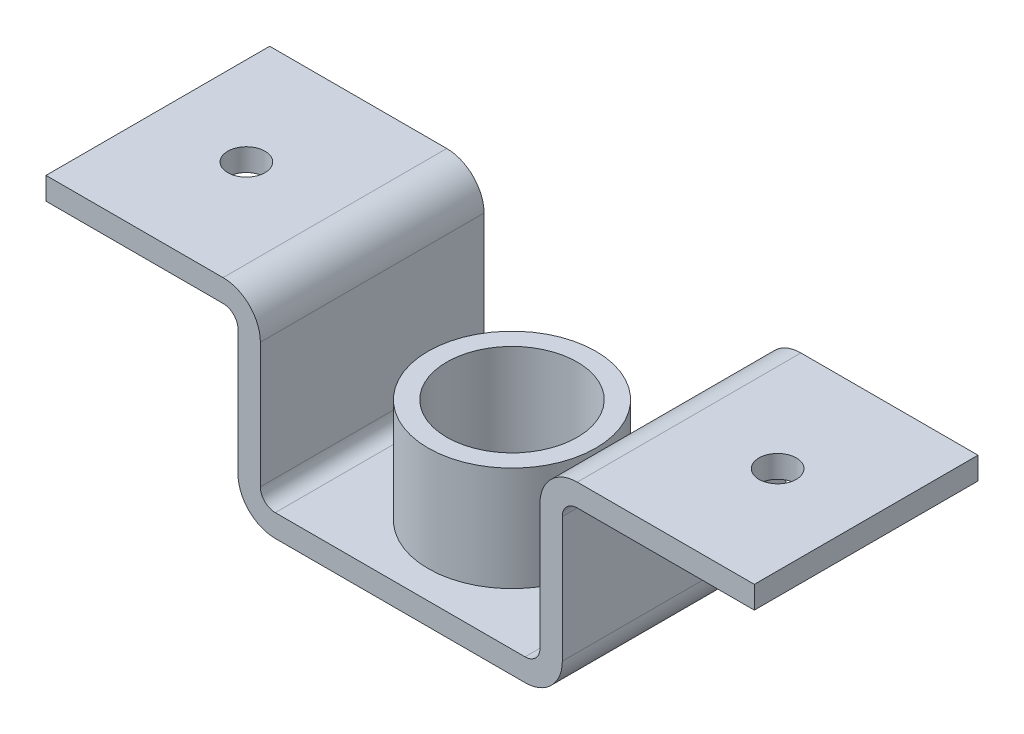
ISO-10303-21;
HEADER;
FILE_DESCRIPTION(('STEP AP214'),'2;1');
FILE_NAME('part.step','',(''),(''),'','','');
FILE_SCHEMA(('AUTOMOTIVE_DESIGN { 1 0 10303 214 1 1 1 1 }'));
ENDSEC;
DATA;
#1=APPLICATION_CONTEXT('core data for automotive mechanical design processes');
#2=APPLICATION_PROTOCOL_DEFINITION('international standard','automotive_design',2000,#1);
#3=PRODUCT_CONTEXT('',#1,'mechanical');
#4=PRODUCT('Part','Part','',(#3));
#5=PRODUCT_RELATED_PRODUCT_CATEGORY('part','',(#4));
#6=PRODUCT_DEFINITION_FORMATION('','',#4);
#7=PRODUCT_DEFINITION_CONTEXT('part definition',#1,'design');
#8=PRODUCT_DEFINITION('design','',#6,#7);
#9=PRODUCT_DEFINITION_SHAPE('','',#8);
#10=(LENGTH_UNIT() NAMED_UNIT(*) SI_UNIT(.MILLI.,.METRE.));
#11=(NAMED_UNIT(*) PLANE_ANGLE_UNIT() SI_UNIT($,.RADIAN.));
#12=(NAMED_UNIT(*) SI_UNIT($,.STERADIAN.) SOLID_ANGLE_UNIT());
#13=UNCERTAINTY_MEASURE_WITH_UNIT(LENGTH_MEASURE(1.E-05),#10,'distance_accuracy_value','');
#14=(GEOMETRIC_REPRESENTATION_CONTEXT(3) GLOBAL_UNCERTAINTY_ASSIGNED_CONTEXT((#13)) GLOBAL_UNIT_ASSIGNED_CONTEXT((#10,
#11,#12)) REPRESENTATION_CONTEXT('',''));
#15=CARTESIAN_POINT('',(0.,0.,0.));
#16=DIRECTION('',(0.,0.,1.));
#17=DIRECTION('',(1.,0.,0.));
#18=AXIS2_PLACEMENT_3D('',#15,#16,#17);
#19=CARTESIAN_POINT('',(-187.5,30.,150.));
#20=DIRECTION('',(0.,-1.,0.));
#21=DIRECTION('',(0.,0.,-1.));
#22=AXIS2_PLACEMENT_3D('',#19,#20,#21);
#23=PLANE('',#22);
#24=CARTESIAN_POINT('',(0.,30.,0.));
#25=DIRECTION('',(0.,1.,0.));
#26=DIRECTION('',(0.,0.,1.));
#27=AXIS2_PLACEMENT_3D('',#24,#25,#26);
#28=CIRCLE('',#27,37.5);
#29=CARTESIAN_POINT('',(0.,30.,37.5));
#30=VERTEX_POINT('',#29);
#31=EDGE_CURVE('E407',#30,#30,#28,.T.);
#32=ORIENTED_EDGE('',*,*,#31,.F.);
#33=EDGE_LOOP('',(#32));
#34=FACE_BOUND('',#33,.T.);
#35=CARTESIAN_POINT('',(0.,30.,0.));
#36=DIRECTION('',(0.,1.,0.));
#37=DIRECTION('',(0.,0.,1.));
#38=AXIS2_PLACEMENT_3D('',#35,#36,#37);
#39=CIRCLE('',#38,87.5);
#40=CARTESIAN_POINT('',(0.,30.,87.5));
#41=VERTEX_POINT('',#40);
#42=EDGE_CURVE('E414',#41,#41,#39,.T.);
#43=ORIENTED_EDGE('',*,*,#42,.T.);
#44=EDGE_LOOP('',(#43));
#45=FACE_BOUND('',#44,.T.);
#46=ADVANCED_FACE('F39',(#34,#45),#23,.F.);
#47=CARTESIAN_POINT('',(187.5,30.,150.));
#48=DIRECTION('',(1.,0.,0.));
#49=DIRECTION('',(0.,1.,0.));
#50=AXIS2_PLACEMENT_3D('',#47,#48,#49);
#51=PLANE('',#50);
#52=DIRECTION('',(0.,-1.,0.));
#53=VECTOR('',#52,1.);
#54=CARTESIAN_POINT('',(187.5,30.,150.));
#55=LINE('',#54,#53);
#56=CARTESIAN_POINT('',(187.5,218.,150.));
#57=VERTEX_POINT('',#56);
#58=CARTESIAN_POINT('',(187.5,50.,150.));
#59=VERTEX_POINT('',#58);
#60=EDGE_CURVE('E253',#57,#59,#55,.T.);
#61=ORIENTED_EDGE('',*,*,#60,.F.);
#62=DIRECTION('',(0.,0.,-1.));
#63=VECTOR('',#62,1.);
#64=CARTESIAN_POINT('',(187.5,218.,150.));
#65=LINE('',#64,#63);
#66=CARTESIAN_POINT('',(187.5,218.,-150.));
#67=VERTEX_POINT('',#66);
#68=EDGE_CURVE('E323',#57,#67,#65,.T.);
#69=ORIENTED_EDGE('',*,*,#68,.T.);
#70=DIRECTION('',(0.,-1.,0.));
#71=VECTOR('',#70,1.);
#72=CARTESIAN_POINT('',(187.5,30.,-150.));
#73=LINE('',#72,#71);
#74=CARTESIAN_POINT('',(187.5,50.,-150.));
#75=VERTEX_POINT('',#74);
#76=EDGE_CURVE('E224',#67,#75,#73,.T.);
#77=ORIENTED_EDGE('',*,*,#76,.T.);
#78=DIRECTION('',(0.,0.,-1.));
#79=VECTOR('',#78,1.);
#80=CARTESIAN_POINT('',(187.5,50.,150.));
#81=LINE('',#80,#79);
#82=EDGE_CURVE('E275',#75,#59,#81,.F.);
#83=ORIENTED_EDGE('',*,*,#82,.T.);
#84=EDGE_LOOP('',(#61,#69,#77,#83));
#85=FACE_BOUND('',#84,.T.);
#86=ADVANCED_FACE('F390',(#85),#51,.F.);
#87=CARTESIAN_POINT('',(0.,30.,0.));
#88=DIRECTION('',(0.,-1.,0.));
#89=DIRECTION('',(0.,0.,-1.));
#90=AXIS2_PLACEMENT_3D('',#87,#88,#89);
#91=CIRCLE('',#90,112.5);
#92=CARTESIAN_POINT('',(0.,30.,-112.5));
#93=VERTEX_POINT('',#92);
#94=EDGE_CURVE('E11',#93,#93,#91,.F.);
#95=ORIENTED_EDGE('',*,*,#94,.F.);
#96=EDGE_LOOP('',(#95));
#97=FACE_BOUND('',#96,.T.);
#98=DIRECTION('',(-1.,0.,0.));
#99=VECTOR('',#98,1.);
#100=CARTESIAN_POINT('',(-187.5,30.,150.));
#101=LINE('',#100,#99);
#102=CARTESIAN_POINT('',(167.5,30.,150.));
#103=VERTEX_POINT('',#102);
#104=CARTESIAN_POINT('',(-167.5,30.,150.));
#105=VERTEX_POINT('',#104);
#106=EDGE_CURVE('E337',#103,#105,#101,.T.);
#107=ORIENTED_EDGE('',*,*,#106,.F.);
#108=DIRECTION('',(0.,0.,-1.));
#109=VECTOR('',#108,1.);
#110=CARTESIAN_POINT('',(167.5,30.,-150.));
#111=LINE('',#110,#109);
#112=CARTESIAN_POINT('',(167.5,30.,-150.));
#113=VERTEX_POINT('',#112);
#114=EDGE_CURVE('E272',#103,#113,#111,.T.);
#115=ORIENTED_EDGE('',*,*,#114,.T.);
#116=DIRECTION('',(-1.,0.,0.));
#117=VECTOR('',#116,1.);
#118=CARTESIAN_POINT('',(-187.5,30.,-150.));
#119=LINE('',#118,#117);
#120=CARTESIAN_POINT('',(-167.5,30.,-150.));
#121=VERTEX_POINT('',#120);
#122=EDGE_CURVE('E226',#113,#121,#119,.T.);
#123=ORIENTED_EDGE('',*,*,#122,.T.);
#124=DIRECTION('',(0.,0.,-1.));
#125=VECTOR('',#124,1.);
#126=CARTESIAN_POINT('',(-167.5,30.,150.));
#127=LINE('',#126,#125);
#128=EDGE_CURVE('E270',#121,#105,#127,.F.);
#129=ORIENTED_EDGE('',*,*,#128,.T.);
#130=EDGE_LOOP('',(#107,#115,#123,#129));
#131=FACE_BOUND('',#130,.T.);
#132=ADVANCED_FACE('F400',(#97,#131),#23,.F.);
#133=CARTESIAN_POINT('',(-187.5,30.,150.));
#134=DIRECTION('',(-1.,0.,0.));
#135=DIRECTION('',(0.,0.,1.));
#136=AXIS2_PLACEMENT_3D('',#133,#134,#135);
#137=PLANE('',#136);
#138=DIRECTION('',(0.,1.,0.));
#139=VECTOR('',#138,1.);
#140=CARTESIAN_POINT('',(-187.5,30.,-150.));
#141=LINE('',#140,#139);
#142=CARTESIAN_POINT('',(-187.5,50.,-150.));
#143=VERTEX_POINT('',#142);
#144=CARTESIAN_POINT('',(-187.5,218.,-150.));
#145=VERTEX_POINT('',#144);
#146=EDGE_CURVE('E230',#143,#145,#141,.T.);
#147=ORIENTED_EDGE('',*,*,#146,.T.);
#148=DIRECTION('',(0.,0.,-1.));
#149=VECTOR('',#148,1.);
#150=CARTESIAN_POINT('',(-187.5,218.,150.));
#151=LINE('',#150,#149);
#152=CARTESIAN_POINT('',(-187.5,218.,150.));
#153=VERTEX_POINT('',#152);
#154=EDGE_CURVE('E47',#145,#153,#151,.F.);
#155=ORIENTED_EDGE('',*,*,#154,.T.);
#156=DIRECTION('',(0.,1.,0.));
#157=VECTOR('',#156,1.);
#158=CARTESIAN_POINT('',(-187.5,30.,150.));
#159=LINE('',#158,#157);
#160=CARTESIAN_POINT('',(-187.5,50.,150.));
#161=VERTEX_POINT('',#160);
#162=EDGE_CURVE('E191',#161,#153,#159,.T.);
#163=ORIENTED_EDGE('',*,*,#162,.F.);
#164=DIRECTION('',(0.,0.,-1.));
#165=VECTOR('',#164,1.);
#166=CARTESIAN_POINT('',(-187.5,50.,-150.));
#167=LINE('',#166,#165);
#168=EDGE_CURVE('E278',#161,#143,#167,.T.);
#169=ORIENTED_EDGE('',*,*,#168,.T.);
#170=EDGE_LOOP('',(#147,#155,#163,#169));
#171=FACE_BOUND('',#170,.T.);
#172=ADVANCED_FACE('F331',(#171),#137,.F.);
#173=CARTESIAN_POINT('',(-187.5,268.,150.));
#174=DIRECTION('',(0.,-1.,0.));
#175=DIRECTION('',(1.,0.,0.));
#176=AXIS2_PLACEMENT_3D('',#173,#174,#175);
#177=PLANE('',#176);
#178=CARTESIAN_POINT('',(-356.25,268.,0.));
#179=DIRECTION('',(0.,1.,0.));
#180=DIRECTION('',(0.,0.,1.));
#181=AXIS2_PLACEMENT_3D('',#178,#179,#180);
#182=CIRCLE('',#181,25.);
#183=CARTESIAN_POINT('',(-356.25,268.,25.));
#184=VERTEX_POINT('',#183);
#185=EDGE_CURVE('E422',#184,#184,#182,.T.);
#186=ORIENTED_EDGE('',*,*,#185,.F.);
#187=EDGE_LOOP('',(#186));
#188=FACE_BOUND('',#187,.T.);
#189=DIRECTION('',(-1.,0.,0.));
#190=VECTOR('',#189,1.);
#191=CARTESIAN_POINT('',(-187.5,268.,150.));
#192=LINE('',#191,#190);
#193=CARTESIAN_POINT('',(-237.5,268.,150.));
#194=VERTEX_POINT('',#193);
#195=CARTESIAN_POINT('',(-475.,268.,150.));
#196=VERTEX_POINT('',#195);
#197=EDGE_CURVE('E177',#194,#196,#192,.T.);
#198=ORIENTED_EDGE('',*,*,#197,.F.);
#199=DIRECTION('',(0.,0.,-1.));
#200=VECTOR('',#199,1.);
#201=CARTESIAN_POINT('',(-237.5,268.,150.));
#202=LINE('',#201,#200);
#203=CARTESIAN_POINT('',(-237.5,268.,-150.));
#204=VERTEX_POINT('',#203);
#205=EDGE_CURVE('E327',#194,#204,#202,.T.);
#206=ORIENTED_EDGE('',*,*,#205,.T.);
#207=DIRECTION('',(-1.,0.,0.));
#208=VECTOR('',#207,1.);
#209=CARTESIAN_POINT('',(-187.5,268.,-150.));
#210=LINE('',#209,#208);
#211=CARTESIAN_POINT('',(-475.,268.,-150.));
#212=VERTEX_POINT('',#211);
#213=EDGE_CURVE('E197',#204,#212,#210,.T.);
#214=ORIENTED_EDGE('',*,*,#213,.T.);
#215=DIRECTION('',(0.,0.,-1.));
#216=VECTOR('',#215,1.);
#217=CARTESIAN_POINT('',(-475.,268.,150.));
#218=LINE('',#217,#216);
#219=EDGE_CURVE('E194',#196,#212,#218,.T.);
#220=ORIENTED_EDGE('',*,*,#219,.F.);
#221=EDGE_LOOP('',(#198,#206,#214,#220));
#222=FACE_BOUND('',#221,.T.);
#223=ADVANCED_FACE('F195',(#188,#222),#177,.F.);
#224=CARTESIAN_POINT('',(-475.,238.,150.));
#225=DIRECTION('',(1.,0.,0.));
#226=DIRECTION('',(0.,0.,-1.));
#227=AXIS2_PLACEMENT_3D('',#224,#225,#226);
#228=PLANE('',#227);
#229=DIRECTION('',(0.,-1.,0.));
#230=VECTOR('',#229,1.);
#231=CARTESIAN_POINT('',(-475.,238.,-150.));
#232=LINE('',#231,#230);
#233=CARTESIAN_POINT('',(-475.,238.,-150.));
#234=VERTEX_POINT('',#233);
#235=EDGE_CURVE('E234',#212,#234,#232,.T.);
#236=ORIENTED_EDGE('',*,*,#235,.T.);
#237=DIRECTION('',(0.,0.,-1.));
#238=VECTOR('',#237,1.);
#239=CARTESIAN_POINT('',(-475.,238.,150.));
#240=LINE('',#239,#238);
#241=CARTESIAN_POINT('',(-475.,238.,150.));
#242=VERTEX_POINT('',#241);
#243=EDGE_CURVE('E201',#242,#234,#240,.T.);
#244=ORIENTED_EDGE('',*,*,#243,.F.);
#245=DIRECTION('',(0.,-1.,0.));
#246=VECTOR('',#245,1.);
#247=CARTESIAN_POINT('',(-475.,238.,150.));
#248=LINE('',#247,#246);
#249=EDGE_CURVE('E183',#196,#242,#248,.T.);
#250=ORIENTED_EDGE('',*,*,#249,.F.);
#251=ORIENTED_EDGE('',*,*,#219,.T.);
#252=EDGE_LOOP('',(#236,#244,#250,#251));
#253=FACE_BOUND('',#252,.T.);
#254=ADVANCED_FACE('F203',(#253),#228,.F.);
#255=CARTESIAN_POINT('',(-217.5,238.,150.));
#256=DIRECTION('',(0.,1.,0.));
#257=DIRECTION('',(-1.,0.,0.));
#258=AXIS2_PLACEMENT_3D('',#255,#256,#257);
#259=PLANE('',#258);
#260=CARTESIAN_POINT('',(-356.25,238.,0.));
#261=DIRECTION('',(0.,1.,0.));
#262=DIRECTION('',(-1.,0.,0.));
#263=AXIS2_PLACEMENT_3D('',#260,#261,#262);
#264=CIRCLE('',#263,25.);
#265=CARTESIAN_POINT('',(-381.25,238.,0.));
#266=VERTEX_POINT('',#265);
#267=EDGE_CURVE('E417',#266,#266,#264,.F.);
#268=ORIENTED_EDGE('',*,*,#267,.F.);
#269=EDGE_LOOP('',(#268));
#270=FACE_BOUND('',#269,.T.);
#271=DIRECTION('',(1.,0.,0.));
#272=VECTOR('',#271,1.);
#273=CARTESIAN_POINT('',(-217.5,238.,-150.));
#274=LINE('',#273,#272);
#275=CARTESIAN_POINT('',(-237.5,238.,-150.));
#276=VERTEX_POINT('',#275);
#277=EDGE_CURVE('E236',#234,#276,#274,.T.);
#278=ORIENTED_EDGE('',*,*,#277,.T.);
#279=DIRECTION('',(0.,0.,-1.));
#280=VECTOR('',#279,1.);
#281=CARTESIAN_POINT('',(-237.5,238.,150.));
#282=LINE('',#281,#280);
#283=CARTESIAN_POINT('',(-237.5,238.,150.));
#284=VERTEX_POINT('',#283);
#285=EDGE_CURVE('E262',#276,#284,#282,.F.);
#286=ORIENTED_EDGE('',*,*,#285,.T.);
#287=DIRECTION('',(1.,0.,0.));
#288=VECTOR('',#287,1.);
#289=CARTESIAN_POINT('',(-217.5,238.,150.));
#290=LINE('',#289,#288);
#291=EDGE_CURVE('E206',#242,#284,#290,.T.);
#292=ORIENTED_EDGE('',*,*,#291,.F.);
#293=ORIENTED_EDGE('',*,*,#243,.T.);
#294=EDGE_LOOP('',(#278,#286,#292,#293));
#295=FACE_BOUND('',#294,.T.);
#296=ADVANCED_FACE('F343',(#270,#295),#259,.F.);
#297=CARTESIAN_POINT('',(-217.5,0.,150.));
#298=DIRECTION('',(1.,0.,0.));
#299=DIRECTION('',(0.,1.,0.));
#300=AXIS2_PLACEMENT_3D('',#297,#298,#299);
#301=PLANE('',#300);
#302=DIRECTION('',(0.,-1.,0.));
#303=VECTOR('',#302,1.);
#304=CARTESIAN_POINT('',(-217.5,0.,-150.));
#305=LINE('',#304,#303);
#306=CARTESIAN_POINT('',(-217.5,218.,-150.));
#307=VERTEX_POINT('',#306);
#308=CARTESIAN_POINT('',(-217.5,50.,-150.));
#309=VERTEX_POINT('',#308);
#310=EDGE_CURVE('E239',#307,#309,#305,.T.);
#311=ORIENTED_EDGE('',*,*,#310,.T.);
#312=DIRECTION('',(0.,0.,-1.));
#313=VECTOR('',#312,1.);
#314=CARTESIAN_POINT('',(-217.5,50.,150.));
#315=LINE('',#314,#313);
#316=CARTESIAN_POINT('',(-217.5,50.,150.));
#317=VERTEX_POINT('',#316);
#318=EDGE_CURVE('E312',#309,#317,#315,.F.);
#319=ORIENTED_EDGE('',*,*,#318,.T.);
#320=DIRECTION('',(0.,-1.,0.));
#321=VECTOR('',#320,1.);
#322=CARTESIAN_POINT('',(-217.5,0.,150.));
#323=LINE('',#322,#321);
#324=CARTESIAN_POINT('',(-217.5,218.,150.));
#325=VERTEX_POINT('',#324);
#326=EDGE_CURVE('E208',#325,#317,#323,.T.);
#327=ORIENTED_EDGE('',*,*,#326,.F.);
#328=DIRECTION('',(0.,0.,-1.));
#329=VECTOR('',#328,1.);
#330=CARTESIAN_POINT('',(-217.5,218.,-150.));
#331=LINE('',#330,#329);
#332=EDGE_CURVE('E200',#325,#307,#331,.T.);
#333=ORIENTED_EDGE('',*,*,#332,.T.);
#334=EDGE_LOOP('',(#311,#319,#327,#333));
#335=FACE_BOUND('',#334,.T.);
#336=ADVANCED_FACE('F352',(#335),#301,.F.);
#337=CARTESIAN_POINT('',(-217.5,0.,150.));
#338=DIRECTION('',(0.,1.,0.));
#339=DIRECTION('',(0.,0.,1.));
#340=AXIS2_PLACEMENT_3D('',#337,#338,#339);
#341=PLANE('',#340);
#342=CARTESIAN_POINT('',(0.,0.,0.));
#343=DIRECTION('',(0.,1.,0.));
#344=DIRECTION('',(0.,0.,1.));
#345=AXIS2_PLACEMENT_3D('',#342,#343,#344);
#346=CIRCLE('',#345,37.5);
#347=CARTESIAN_POINT('',(0.,0.,37.5));
#348=VERTEX_POINT('',#347);
#349=EDGE_CURVE('E227',#348,#348,#346,.F.);
#350=ORIENTED_EDGE('',*,*,#349,.F.);
#351=EDGE_LOOP('',(#350));
#352=FACE_BOUND('',#351,.T.);
#353=DIRECTION('',(1.,0.,0.));
#354=VECTOR('',#353,1.);
#355=CARTESIAN_POINT('',(-217.5,0.,150.));
#356=LINE('',#355,#354);
#357=CARTESIAN_POINT('',(-167.5,0.,150.));
#358=VERTEX_POINT('',#357);
#359=CARTESIAN_POINT('',(167.5,0.,150.));
#360=VERTEX_POINT('',#359);
#361=EDGE_CURVE('E213',#358,#360,#356,.T.);
#362=ORIENTED_EDGE('',*,*,#361,.F.);
#363=DIRECTION('',(0.,0.,-1.));
#364=VECTOR('',#363,1.);
#365=CARTESIAN_POINT('',(-167.5,0.,150.));
#366=LINE('',#365,#364);
#367=CARTESIAN_POINT('',(-167.5,0.,-150.));
#368=VERTEX_POINT('',#367);
#369=EDGE_CURVE('E301',#358,#368,#366,.T.);
#370=ORIENTED_EDGE('',*,*,#369,.T.);
#371=DIRECTION('',(1.,0.,0.));
#372=VECTOR('',#371,1.);
#373=CARTESIAN_POINT('',(-217.5,0.,-150.));
#374=LINE('',#373,#372);
#375=CARTESIAN_POINT('',(167.5,0.,-150.));
#376=VERTEX_POINT('',#375);
#377=EDGE_CURVE('E242',#368,#376,#374,.T.);
#378=ORIENTED_EDGE('',*,*,#377,.T.);
#379=DIRECTION('',(0.,0.,-1.));
#380=VECTOR('',#379,1.);
#381=CARTESIAN_POINT('',(167.5,0.,150.));
#382=LINE('',#381,#380);
#383=EDGE_CURVE('E299',#376,#360,#382,.F.);
#384=ORIENTED_EDGE('',*,*,#383,.T.);
#385=EDGE_LOOP('',(#362,#370,#378,#384));
#386=FACE_BOUND('',#385,.T.);
#387=ADVANCED_FACE('F360',(#352,#386),#341,.F.);
#388=CARTESIAN_POINT('',(217.5,0.,150.));
#389=DIRECTION('',(-1.,0.,0.));
#390=DIRECTION('',(0.,-1.,0.));
#391=AXIS2_PLACEMENT_3D('',#388,#389,#390);
#392=PLANE('',#391);
#393=DIRECTION('',(0.,1.,0.));
#394=VECTOR('',#393,1.);
#395=CARTESIAN_POINT('',(217.5,0.,150.));
#396=LINE('',#395,#394);
#397=CARTESIAN_POINT('',(217.5,50.,150.));
#398=VERTEX_POINT('',#397);
#399=CARTESIAN_POINT('',(217.5,218.,150.));
#400=VERTEX_POINT('',#399);
#401=EDGE_CURVE('E215',#398,#400,#396,.T.);
#402=ORIENTED_EDGE('',*,*,#401,.F.);
#403=DIRECTION('',(0.,0.,-1.));
#404=VECTOR('',#403,1.);
#405=CARTESIAN_POINT('',(217.5,50.,150.));
#406=LINE('',#405,#404);
#407=CARTESIAN_POINT('',(217.5,50.,-150.));
#408=VERTEX_POINT('',#407);
#409=EDGE_CURVE('E320',#398,#408,#406,.T.);
#410=ORIENTED_EDGE('',*,*,#409,.T.);
#411=DIRECTION('',(0.,1.,0.));
#412=VECTOR('',#411,1.);
#413=CARTESIAN_POINT('',(217.5,0.,-150.));
#414=LINE('',#413,#412);
#415=CARTESIAN_POINT('',(217.5,218.,-150.));
#416=VERTEX_POINT('',#415);
#417=EDGE_CURVE('E245',#408,#416,#414,.T.);
#418=ORIENTED_EDGE('',*,*,#417,.T.);
#419=DIRECTION('',(0.,0.,-1.));
#420=VECTOR('',#419,1.);
#421=CARTESIAN_POINT('',(217.5,218.,150.));
#422=LINE('',#421,#420);
#423=EDGE_CURVE('E267',#416,#400,#422,.F.);
#424=ORIENTED_EDGE('',*,*,#423,.T.);
#425=EDGE_LOOP('',(#402,#410,#418,#424));
#426=FACE_BOUND('',#425,.T.);
#427=ADVANCED_FACE('F367',(#426),#392,.F.);
#428=CARTESIAN_POINT('',(217.5,238.,150.));
#429=DIRECTION('',(0.,1.,0.));
#430=DIRECTION('',(0.,0.,1.));
#431=AXIS2_PLACEMENT_3D('',#428,#429,#430);
#432=PLANE('',#431);
#433=CARTESIAN_POINT('',(356.25,238.,0.));
#434=DIRECTION('',(0.,1.,0.));
#435=DIRECTION('',(-1.,0.,0.));
#436=AXIS2_PLACEMENT_3D('',#433,#434,#435);
#437=CIRCLE('',#436,25.);
#438=CARTESIAN_POINT('',(331.25,238.,0.));
#439=VERTEX_POINT('',#438);
#440=EDGE_CURVE('E425',#439,#439,#437,.T.);
#441=ORIENTED_EDGE('',*,*,#440,.T.);
#442=EDGE_LOOP('',(#441));
#443=FACE_BOUND('',#442,.T.);
#444=DIRECTION('',(1.,0.,0.));
#445=VECTOR('',#444,1.);
#446=CARTESIAN_POINT('',(217.5,238.,150.));
#447=LINE('',#446,#445);
#448=CARTESIAN_POINT('',(237.5,238.,150.));
#449=VERTEX_POINT('',#448);
#450=CARTESIAN_POINT('',(475.,238.,150.));
#451=VERTEX_POINT('',#450);
#452=EDGE_CURVE('E217',#449,#451,#447,.T.);
#453=ORIENTED_EDGE('',*,*,#452,.F.);
#454=DIRECTION('',(0.,0.,-1.));
#455=VECTOR('',#454,1.);
#456=CARTESIAN_POINT('',(237.5,238.,-150.));
#457=LINE('',#456,#455);
#458=CARTESIAN_POINT('',(237.5,238.,-150.));
#459=VERTEX_POINT('',#458);
#460=EDGE_CURVE('E264',#449,#459,#457,.T.);
#461=ORIENTED_EDGE('',*,*,#460,.T.);
#462=DIRECTION('',(1.,0.,0.));
#463=VECTOR('',#462,1.);
#464=CARTESIAN_POINT('',(217.5,238.,-150.));
#465=LINE('',#464,#463);
#466=CARTESIAN_POINT('',(475.,238.,-150.));
#467=VERTEX_POINT('',#466);
#468=EDGE_CURVE('E247',#459,#467,#465,.T.);
#469=ORIENTED_EDGE('',*,*,#468,.T.);
#470=DIRECTION('',(0.,0.,-1.));
#471=VECTOR('',#470,1.);
#472=CARTESIAN_POINT('',(475.,238.,150.));
#473=LINE('',#472,#471);
#474=EDGE_CURVE('E256',#451,#467,#473,.T.);
#475=ORIENTED_EDGE('',*,*,#474,.F.);
#476=EDGE_LOOP('',(#453,#461,#469,#475));
#477=FACE_BOUND('',#476,.T.);
#478=ADVANCED_FACE('F378',(#443,#477),#432,.F.);
#479=CARTESIAN_POINT('',(475.,268.,150.));
#480=DIRECTION('',(-1.,0.,0.));
#481=DIRECTION('',(0.,0.,1.));
#482=AXIS2_PLACEMENT_3D('',#479,#480,#481);
#483=PLANE('',#482);
#484=DIRECTION('',(0.,1.,0.));
#485=VECTOR('',#484,1.);
#486=CARTESIAN_POINT('',(475.,268.,-150.));
#487=LINE('',#486,#485);
#488=CARTESIAN_POINT('',(475.,268.,-150.));
#489=VERTEX_POINT('',#488);
#490=EDGE_CURVE('E249',#467,#489,#487,.T.);
#491=ORIENTED_EDGE('',*,*,#490,.T.);
#492=DIRECTION('',(0.,0.,-1.));
#493=VECTOR('',#492,1.);
#494=CARTESIAN_POINT('',(475.,268.,150.));
#495=LINE('',#494,#493);
#496=CARTESIAN_POINT('',(475.,268.,150.));
#497=VERTEX_POINT('',#496);
#498=EDGE_CURVE('E223',#497,#489,#495,.T.);
#499=ORIENTED_EDGE('',*,*,#498,.F.);
#500=DIRECTION('',(0.,1.,0.));
#501=VECTOR('',#500,1.);
#502=CARTESIAN_POINT('',(475.,268.,150.));
#503=LINE('',#502,#501);
#504=EDGE_CURVE('E219',#451,#497,#503,.T.);
#505=ORIENTED_EDGE('',*,*,#504,.F.);
#506=ORIENTED_EDGE('',*,*,#474,.T.);
#507=EDGE_LOOP('',(#491,#499,#505,#506));
#508=FACE_BOUND('',#507,.T.);
#509=ADVANCED_FACE('F382',(#508),#483,.F.);
#510=CARTESIAN_POINT('',(187.5,268.,150.));
#511=DIRECTION('',(0.,-1.,0.));
#512=DIRECTION('',(0.,0.,-1.));
#513=AXIS2_PLACEMENT_3D('',#510,#511,#512);
#514=PLANE('',#513);
#515=CARTESIAN_POINT('',(356.25,268.,0.));
#516=DIRECTION('',(0.,-1.,0.));
#517=DIRECTION('',(0.,0.,1.));
#518=AXIS2_PLACEMENT_3D('',#515,#516,#517);
#519=CIRCLE('',#518,25.);
#520=CARTESIAN_POINT('',(356.25,268.,25.));
#521=VERTEX_POINT('',#520);
#522=EDGE_CURVE('E428',#521,#521,#519,.T.);
#523=ORIENTED_EDGE('',*,*,#522,.T.);
#524=EDGE_LOOP('',(#523));
#525=FACE_BOUND('',#524,.T.);
#526=DIRECTION('',(-1.,0.,0.));
#527=VECTOR('',#526,1.);
#528=CARTESIAN_POINT('',(187.5,268.,-150.));
#529=LINE('',#528,#527);
#530=CARTESIAN_POINT('',(237.5,268.,-150.));
#531=VERTEX_POINT('',#530);
#532=EDGE_CURVE('E251',#489,#531,#529,.T.);
#533=ORIENTED_EDGE('',*,*,#532,.T.);
#534=DIRECTION('',(0.,0.,-1.));
#535=VECTOR('',#534,1.);
#536=CARTESIAN_POINT('',(237.5,268.,150.));
#537=LINE('',#536,#535);
#538=CARTESIAN_POINT('',(237.5,268.,150.));
#539=VERTEX_POINT('',#538);
#540=EDGE_CURVE('E54',#531,#539,#537,.F.);
#541=ORIENTED_EDGE('',*,*,#540,.T.);
#542=DIRECTION('',(-1.,0.,0.));
#543=VECTOR('',#542,1.);
#544=CARTESIAN_POINT('',(187.5,268.,150.));
#545=LINE('',#544,#543);
#546=EDGE_CURVE('E221',#497,#539,#545,.T.);
#547=ORIENTED_EDGE('',*,*,#546,.F.);
#548=ORIENTED_EDGE('',*,*,#498,.T.);
#549=EDGE_LOOP('',(#533,#541,#547,#548));
#550=FACE_BOUND('',#549,.T.);
#551=ADVANCED_FACE('F432',(#525,#550),#514,.F.);
#552=CARTESIAN_POINT('',(0.,0.,150.));
#553=DIRECTION('',(0.,0.,-1.));
#554=DIRECTION('',(-1.,0.,0.));
#555=AXIS2_PLACEMENT_3D('',#552,#553,#554);
#556=PLANE('',#555);
#557=ORIENTED_EDGE('',*,*,#326,.T.);
#558=CARTESIAN_POINT('',(-167.5,50.,150.));
#559=DIRECTION('',(0.,0.,-1.));
#560=DIRECTION('',(-1.,0.,0.));
#561=AXIS2_PLACEMENT_3D('',#558,#559,#560);
#562=CIRCLE('',#561,50.);
#563=EDGE_CURVE('E318',#317,#358,#562,.F.);
#564=ORIENTED_EDGE('',*,*,#563,.T.);
#565=ORIENTED_EDGE('',*,*,#361,.T.);
#566=CARTESIAN_POINT('',(167.5,50.,150.));
#567=DIRECTION('',(0.,0.,-1.));
#568=DIRECTION('',(-1.,0.,0.));
#569=AXIS2_PLACEMENT_3D('',#566,#567,#568);
#570=CIRCLE('',#569,50.);
#571=EDGE_CURVE('E62',#360,#398,#570,.F.);
#572=ORIENTED_EDGE('',*,*,#571,.T.);
#573=ORIENTED_EDGE('',*,*,#401,.T.);
#574=CARTESIAN_POINT('',(237.5,218.,150.));
#575=DIRECTION('',(0.,0.,-1.));
#576=DIRECTION('',(-1.,0.,0.));
#577=AXIS2_PLACEMENT_3D('',#574,#575,#576);
#578=CIRCLE('',#577,20.);
#579=EDGE_CURVE('E288',#400,#449,#578,.T.);
#580=ORIENTED_EDGE('',*,*,#579,.T.);
#581=ORIENTED_EDGE('',*,*,#452,.T.);
#582=ORIENTED_EDGE('',*,*,#504,.T.);
#583=ORIENTED_EDGE('',*,*,#546,.T.);
#584=CARTESIAN_POINT('',(237.5,218.,150.));
#585=DIRECTION('',(0.,0.,-1.));
#586=DIRECTION('',(-1.,0.,0.));
#587=AXIS2_PLACEMENT_3D('',#584,#585,#586);
#588=CIRCLE('',#587,50.);
#589=EDGE_CURVE('E315',#539,#57,#588,.F.);
#590=ORIENTED_EDGE('',*,*,#589,.T.);
#591=ORIENTED_EDGE('',*,*,#60,.T.);
#592=CARTESIAN_POINT('',(167.5,50.,150.));
#593=DIRECTION('',(0.,0.,-1.));
#594=DIRECTION('',(-1.,0.,0.));
#595=AXIS2_PLACEMENT_3D('',#592,#593,#594);
#596=CIRCLE('',#595,20.);
#597=EDGE_CURVE('E293',#59,#103,#596,.T.);
#598=ORIENTED_EDGE('',*,*,#597,.T.);
#599=ORIENTED_EDGE('',*,*,#106,.T.);
#600=CARTESIAN_POINT('',(-167.5,50.,150.));
#601=DIRECTION('',(0.,0.,-1.));
#602=DIRECTION('',(-1.,0.,0.));
#603=AXIS2_PLACEMENT_3D('',#600,#601,#602);
#604=CIRCLE('',#603,20.);
#605=EDGE_CURVE('E297',#105,#161,#604,.T.);
#606=ORIENTED_EDGE('',*,*,#605,.T.);
#607=ORIENTED_EDGE('',*,*,#162,.T.);
#608=CARTESIAN_POINT('',(-237.5,218.,150.));
#609=DIRECTION('',(0.,0.,-1.));
#610=DIRECTION('',(-1.,0.,0.));
#611=AXIS2_PLACEMENT_3D('',#608,#609,#610);
#612=CIRCLE('',#611,50.);
#613=EDGE_CURVE('E187',#153,#194,#612,.F.);
#614=ORIENTED_EDGE('',*,*,#613,.T.);
#615=ORIENTED_EDGE('',*,*,#197,.T.);
#616=ORIENTED_EDGE('',*,*,#249,.T.);
#617=ORIENTED_EDGE('',*,*,#291,.T.);
#618=CARTESIAN_POINT('',(-237.5,218.,150.));
#619=DIRECTION('',(0.,0.,-1.));
#620=DIRECTION('',(-1.,0.,0.));
#621=AXIS2_PLACEMENT_3D('',#618,#619,#620);
#622=CIRCLE('',#621,20.);
#623=EDGE_CURVE('E283',#284,#325,#622,.T.);
#624=ORIENTED_EDGE('',*,*,#623,.T.);
#625=EDGE_LOOP('',(#557,#564,#565,#572,#573,#580,#581,#582,#583,#590,#591,#598,#599,#606,#607,
#614,#615,#616,#617,#624));
#626=FACE_BOUND('',#625,.T.);
#627=ADVANCED_FACE('F180',(#626),#556,.F.);
#628=CARTESIAN_POINT('',(0.,0.,-150.));
#629=DIRECTION('',(0.,0.,-1.));
#630=DIRECTION('',(-1.,0.,0.));
#631=AXIS2_PLACEMENT_3D('',#628,#629,#630);
#632=PLANE('',#631);
#633=ORIENTED_EDGE('',*,*,#377,.F.);
#634=CARTESIAN_POINT('',(-167.5,50.,-150.));
#635=DIRECTION('',(0.,0.,-1.));
#636=DIRECTION('',(-1.,0.,0.));
#637=AXIS2_PLACEMENT_3D('',#634,#635,#636);
#638=CIRCLE('',#637,50.);
#639=EDGE_CURVE('E310',#368,#309,#638,.T.);
#640=ORIENTED_EDGE('',*,*,#639,.T.);
#641=ORIENTED_EDGE('',*,*,#310,.F.);
#642=CARTESIAN_POINT('',(-237.5,218.,-150.));
#643=DIRECTION('',(0.,0.,-1.));
#644=DIRECTION('',(-1.,0.,0.));
#645=AXIS2_PLACEMENT_3D('',#642,#643,#644);
#646=CIRCLE('',#645,20.);
#647=EDGE_CURVE('E281',#307,#276,#646,.F.);
#648=ORIENTED_EDGE('',*,*,#647,.T.);
#649=ORIENTED_EDGE('',*,*,#277,.F.);
#650=ORIENTED_EDGE('',*,*,#235,.F.);
#651=ORIENTED_EDGE('',*,*,#213,.F.);
#652=CARTESIAN_POINT('',(-237.5,218.,-150.));
#653=DIRECTION('',(0.,0.,-1.));
#654=DIRECTION('',(-1.,0.,0.));
#655=AXIS2_PLACEMENT_3D('',#652,#653,#654);
#656=CIRCLE('',#655,50.);
#657=EDGE_CURVE('E304',#204,#145,#656,.T.);
#658=ORIENTED_EDGE('',*,*,#657,.T.);
#659=ORIENTED_EDGE('',*,*,#146,.F.);
#660=CARTESIAN_POINT('',(-167.5,50.,-150.));
#661=DIRECTION('',(0.,0.,-1.));
#662=DIRECTION('',(-1.,0.,0.));
#663=AXIS2_PLACEMENT_3D('',#660,#661,#662);
#664=CIRCLE('',#663,20.);
#665=EDGE_CURVE('E295',#143,#121,#664,.F.);
#666=ORIENTED_EDGE('',*,*,#665,.T.);
#667=ORIENTED_EDGE('',*,*,#122,.F.);
#668=CARTESIAN_POINT('',(167.5,50.,-150.));
#669=DIRECTION('',(0.,0.,-1.));
#670=DIRECTION('',(-1.,0.,0.));
#671=AXIS2_PLACEMENT_3D('',#668,#669,#670);
#672=CIRCLE('',#671,20.);
#673=EDGE_CURVE('E290',#113,#75,#672,.F.);
#674=ORIENTED_EDGE('',*,*,#673,.T.);
#675=ORIENTED_EDGE('',*,*,#76,.F.);
#676=CARTESIAN_POINT('',(237.5,218.,-150.));
#677=DIRECTION('',(0.,0.,-1.));
#678=DIRECTION('',(-1.,0.,0.));
#679=AXIS2_PLACEMENT_3D('',#676,#677,#678);
#680=CIRCLE('',#679,50.);
#681=EDGE_CURVE('E306',#67,#531,#680,.T.);
#682=ORIENTED_EDGE('',*,*,#681,.T.);
#683=ORIENTED_EDGE('',*,*,#532,.F.);
#684=ORIENTED_EDGE('',*,*,#490,.F.);
#685=ORIENTED_EDGE('',*,*,#468,.F.);
#686=CARTESIAN_POINT('',(237.5,218.,-150.));
#687=DIRECTION('',(0.,0.,-1.));
#688=DIRECTION('',(-1.,0.,0.));
#689=AXIS2_PLACEMENT_3D('',#686,#687,#688);
#690=CIRCLE('',#689,20.);
#691=EDGE_CURVE('E285',#459,#416,#690,.F.);
#692=ORIENTED_EDGE('',*,*,#691,.T.);
#693=ORIENTED_EDGE('',*,*,#417,.F.);
#694=CARTESIAN_POINT('',(167.5,50.,-150.));
#695=DIRECTION('',(0.,0.,-1.));
#696=DIRECTION('',(-1.,0.,0.));
#697=AXIS2_PLACEMENT_3D('',#694,#695,#696);
#698=CIRCLE('',#697,50.);
#699=EDGE_CURVE('E308',#408,#376,#698,.T.);
#700=ORIENTED_EDGE('',*,*,#699,.T.);
#701=EDGE_LOOP('',(#633,#640,#641,#648,#649,#650,#651,#658,#659,#666,#667,#674,#675,#682,#683,
#684,#685,#692,#693,#700));
#702=FACE_BOUND('',#701,.T.);
#703=ADVANCED_FACE('F340',(#702),#632,.T.);
#704=CARTESIAN_POINT('',(-237.5,218.,150.));
#705=DIRECTION('',(0.,0.,1.));
#706=DIRECTION('',(1.,0.,0.));
#707=AXIS2_PLACEMENT_3D('',#704,#705,#706);
#708=CYLINDRICAL_SURFACE('',#707,20.);
#709=ORIENTED_EDGE('',*,*,#623,.F.);
#710=ORIENTED_EDGE('',*,*,#285,.F.);
#711=ORIENTED_EDGE('',*,*,#647,.F.);
#712=ORIENTED_EDGE('',*,*,#332,.F.);
#713=EDGE_LOOP('',(#709,#710,#711,#712));
#714=FACE_BOUND('',#713,.T.);
#715=ADVANCED_FACE('F349',(#714),#708,.F.);
#716=CARTESIAN_POINT('',(237.5,218.,150.));
#717=DIRECTION('',(0.,0.,1.));
#718=DIRECTION('',(1.,0.,0.));
#719=AXIS2_PLACEMENT_3D('',#716,#717,#718);
#720=CYLINDRICAL_SURFACE('',#719,20.);
#721=ORIENTED_EDGE('',*,*,#579,.F.);
#722=ORIENTED_EDGE('',*,*,#423,.F.);
#723=ORIENTED_EDGE('',*,*,#691,.F.);
#724=ORIENTED_EDGE('',*,*,#460,.F.);
#725=EDGE_LOOP('',(#721,#722,#723,#724));
#726=FACE_BOUND('',#725,.T.);
#727=ADVANCED_FACE('F374',(#726),#720,.F.);
#728=CARTESIAN_POINT('',(167.5,50.,150.));
#729=DIRECTION('',(0.,0.,1.));
#730=DIRECTION('',(1.,0.,0.));
#731=AXIS2_PLACEMENT_3D('',#728,#729,#730);
#732=CYLINDRICAL_SURFACE('',#731,20.);
#733=ORIENTED_EDGE('',*,*,#597,.F.);
#734=ORIENTED_EDGE('',*,*,#82,.F.);
#735=ORIENTED_EDGE('',*,*,#673,.F.);
#736=ORIENTED_EDGE('',*,*,#114,.F.);
#737=EDGE_LOOP('',(#733,#734,#735,#736));
#738=FACE_BOUND('',#737,.T.);
#739=ADVANCED_FACE('F397',(#738),#732,.F.);
#740=CARTESIAN_POINT('',(-167.5,50.,150.));
#741=DIRECTION('',(0.,0.,1.));
#742=DIRECTION('',(1.,0.,0.));
#743=AXIS2_PLACEMENT_3D('',#740,#741,#742);
#744=CYLINDRICAL_SURFACE('',#743,20.);
#745=ORIENTED_EDGE('',*,*,#605,.F.);
#746=ORIENTED_EDGE('',*,*,#128,.F.);
#747=ORIENTED_EDGE('',*,*,#665,.F.);
#748=ORIENTED_EDGE('',*,*,#168,.F.);
#749=EDGE_LOOP('',(#745,#746,#747,#748));
#750=FACE_BOUND('',#749,.T.);
#751=ADVANCED_FACE('F580',(#750),#744,.F.);
#752=CARTESIAN_POINT('',(-167.5,50.,150.));
#753=DIRECTION('',(0.,0.,-1.));
#754=DIRECTION('',(-1.,0.,0.));
#755=AXIS2_PLACEMENT_3D('',#752,#753,#754);
#756=CYLINDRICAL_SURFACE('',#755,50.);
#757=ORIENTED_EDGE('',*,*,#563,.F.);
#758=ORIENTED_EDGE('',*,*,#318,.F.);
#759=ORIENTED_EDGE('',*,*,#639,.F.);
#760=ORIENTED_EDGE('',*,*,#369,.F.);
#761=EDGE_LOOP('',(#757,#758,#759,#760));
#762=FACE_BOUND('',#761,.T.);
#763=ADVANCED_FACE('F357',(#762),#756,.T.);
#764=CARTESIAN_POINT('',(167.5,50.,150.));
#765=DIRECTION('',(0.,0.,-1.));
#766=DIRECTION('',(-1.,0.,0.));
#767=AXIS2_PLACEMENT_3D('',#764,#765,#766);
#768=CYLINDRICAL_SURFACE('',#767,50.);
#769=ORIENTED_EDGE('',*,*,#571,.F.);
#770=ORIENTED_EDGE('',*,*,#383,.F.);
#771=ORIENTED_EDGE('',*,*,#699,.F.);
#772=ORIENTED_EDGE('',*,*,#409,.F.);
#773=EDGE_LOOP('',(#769,#770,#771,#772));
#774=FACE_BOUND('',#773,.T.);
#775=ADVANCED_FACE('F364',(#774),#768,.T.);
#776=CARTESIAN_POINT('',(237.5,218.,150.));
#777=DIRECTION('',(0.,0.,-1.));
#778=DIRECTION('',(-1.,0.,0.));
#779=AXIS2_PLACEMENT_3D('',#776,#777,#778);
#780=CYLINDRICAL_SURFACE('',#779,50.);
#781=ORIENTED_EDGE('',*,*,#589,.F.);
#782=ORIENTED_EDGE('',*,*,#540,.F.);
#783=ORIENTED_EDGE('',*,*,#681,.F.);
#784=ORIENTED_EDGE('',*,*,#68,.F.);
#785=EDGE_LOOP('',(#781,#782,#783,#784));
#786=FACE_BOUND('',#785,.T.);
#787=ADVANCED_FACE('F387',(#786),#780,.T.);
#788=CARTESIAN_POINT('',(-237.5,218.,150.));
#789=DIRECTION('',(0.,0.,-1.));
#790=DIRECTION('',(-1.,0.,0.));
#791=AXIS2_PLACEMENT_3D('',#788,#789,#790);
#792=CYLINDRICAL_SURFACE('',#791,50.);
#793=ORIENTED_EDGE('',*,*,#613,.F.);
#794=ORIENTED_EDGE('',*,*,#154,.F.);
#795=ORIENTED_EDGE('',*,*,#657,.F.);
#796=ORIENTED_EDGE('',*,*,#205,.F.);
#797=EDGE_LOOP('',(#793,#794,#795,#796));
#798=FACE_BOUND('',#797,.T.);
#799=ADVANCED_FACE('F41',(#798),#792,.T.);
#800=CARTESIAN_POINT('',(0.,-106.066017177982,0.));
#801=DIRECTION('',(0.,1.,0.));
#802=DIRECTION('',(0.,0.,1.));
#803=AXIS2_PLACEMENT_3D('',#800,#801,#802);
#804=CYLINDRICAL_SURFACE('',#803,37.5);
#805=ORIENTED_EDGE('',*,*,#349,.T.);
#806=EDGE_LOOP('',(#805));
#807=FACE_BOUND('',#806,.T.);
#808=ORIENTED_EDGE('',*,*,#31,.T.);
#809=EDGE_LOOP('',(#808));
#810=FACE_BOUND('',#809,.T.);
#811=ADVANCED_FACE('F476',(#807,#810),#804,.F.);
#812=CARTESIAN_POINT('',(0.,170.,0.));
#813=DIRECTION('',(0.,1.,0.));
#814=DIRECTION('',(0.,0.,1.));
#815=AXIS2_PLACEMENT_3D('',#812,#813,#814);
#816=PLANE('',#815);
#817=CARTESIAN_POINT('',(0.,170.,0.));
#818=DIRECTION('',(0.,1.,0.));
#819=DIRECTION('',(0.,0.,1.));
#820=AXIS2_PLACEMENT_3D('',#817,#818,#819);
#821=CIRCLE('',#820,112.5);
#822=CARTESIAN_POINT('',(0.,170.,112.5));
#823=VERTEX_POINT('',#822);
#824=EDGE_CURVE('E410',#823,#823,#821,.T.);
#825=ORIENTED_EDGE('',*,*,#824,.T.);
#826=EDGE_LOOP('',(#825));
#827=FACE_BOUND('',#826,.T.);
#828=CARTESIAN_POINT('',(0.,170.,0.));
#829=DIRECTION('',(0.,1.,0.));
#830=DIRECTION('',(0.,0.,1.));
#831=AXIS2_PLACEMENT_3D('',#828,#829,#830);
#832=CIRCLE('',#831,87.5);
#833=CARTESIAN_POINT('',(0.,170.,87.5));
#834=VERTEX_POINT('',#833);
#835=EDGE_CURVE('E413',#834,#834,#832,.T.);
#836=ORIENTED_EDGE('',*,*,#835,.F.);
#837=EDGE_LOOP('',(#836));
#838=FACE_BOUND('',#837,.T.);
#839=ADVANCED_FACE('F468',(#827,#838),#816,.T.);
#840=CARTESIAN_POINT('',(0.,170.,0.));
#841=DIRECTION('',(0.,-1.,0.));
#842=DIRECTION('',(0.,0.,-1.));
#843=AXIS2_PLACEMENT_3D('',#840,#841,#842);
#844=CYLINDRICAL_SURFACE('',#843,112.5);
#845=ORIENTED_EDGE('',*,*,#824,.F.);
#846=EDGE_LOOP('',(#845));
#847=FACE_BOUND('',#846,.T.);
#848=ORIENTED_EDGE('',*,*,#94,.T.);
#849=EDGE_LOOP('',(#848));
#850=FACE_BOUND('',#849,.T.);
#851=ADVANCED_FACE('F466',(#847,#850),#844,.T.);
#852=CARTESIAN_POINT('',(0.,170.,0.));
#853=DIRECTION('',(0.,-1.,0.));
#854=DIRECTION('',(0.,0.,-1.));
#855=AXIS2_PLACEMENT_3D('',#852,#853,#854);
#856=CYLINDRICAL_SURFACE('',#855,87.5);
#857=ORIENTED_EDGE('',*,*,#835,.T.);
#858=EDGE_LOOP('',(#857));
#859=FACE_BOUND('',#858,.T.);
#860=ORIENTED_EDGE('',*,*,#42,.F.);
#861=EDGE_LOOP('',(#860));
#862=FACE_BOUND('',#861,.T.);
#863=ADVANCED_FACE('F443',(#859,#862),#856,.F.);
#864=CARTESIAN_POINT('',(-356.25,167.289321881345,0.));
#865=DIRECTION('',(0.,1.,0.));
#866=DIRECTION('',(0.,0.,1.));
#867=AXIS2_PLACEMENT_3D('',#864,#865,#866);
#868=CYLINDRICAL_SURFACE('',#867,25.);
#869=ORIENTED_EDGE('',*,*,#267,.T.);
#870=EDGE_LOOP('',(#869));
#871=FACE_BOUND('',#870,.T.);
#872=ORIENTED_EDGE('',*,*,#185,.T.);
#873=EDGE_LOOP('',(#872));
#874=FACE_BOUND('',#873,.T.);
#875=ADVANCED_FACE('F436',(#871,#874),#868,.F.);
#876=CARTESIAN_POINT('',(356.25,167.289321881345,0.));
#877=DIRECTION('',(0.,1.,0.));
#878=DIRECTION('',(0.,0.,1.));
#879=AXIS2_PLACEMENT_3D('',#876,#877,#878);
#880=CYLINDRICAL_SURFACE('',#879,25.);
#881=ORIENTED_EDGE('',*,*,#440,.F.);
#882=EDGE_LOOP('',(#881));
#883=FACE_BOUND('',#882,.T.);
#884=ORIENTED_EDGE('',*,*,#522,.F.);
#885=EDGE_LOOP('',(#884));
#886=FACE_BOUND('',#885,.T.);
#887=ADVANCED_FACE('F434',(#883,#886),#880,.F.);
#888=CLOSED_SHELL('',(#46,#86,#132,#172,#223,#254,#296,#336,#387,#427,#478,#509,#551,#627,#703,
#715,#727,#739,#751,#763,#775,#787,#799,#811,#839,#851,#863,#875,#887));
#889=MANIFOLD_SOLID_BREP('B2',#888);
#890=ADVANCED_BREP_SHAPE_REPRESENTATION('',(#18,#889),#14);
#891=SHAPE_DEFINITION_REPRESENTATION(#9,#890);
ENDSEC;
END-ISO-10303-21;
